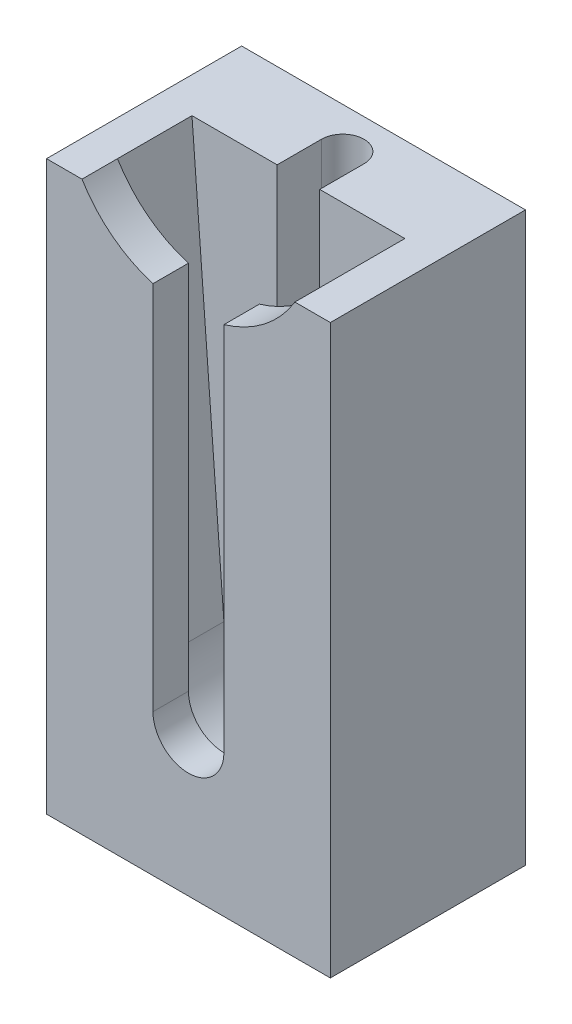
from build123d import *

# Parameters (mm, degrees)
SKICA1_W                      = 8
SKICA1_H                      = 16
P_IDAT_VYSUNUT_M1_DEPTH       = 4.5
ODEBRAT_VYSUNUT_M1_DEPTH      = 19.445866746
ODEBRAT_VYSUNUT_M1_DEPTH_BACK = 2.1
SKICA3_W                      = 8
SKICA3_H                      = 16
P_IDAT_VYSUNUT_M2_DEPTH       = 1
ODEBRAT_VYSUNUT_M2_DEPTH      = 19.714967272
ODEBRAT_VYSUNUT_M2_DEPTH_BACK = 1
ODEBRAT_VYSUNUT_M8_DEPTH      = 19.714967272
ODEBRAT_VYSUNUT_M8_DEPTH_BACK = 10
SKICA10_R                     = 3.5
ODEBRAT_VYSUNUT_M9_DEPTH      = 1
SKICA11_R                     = 0.75
ODEBRAT_VYSUNUT_M10_DEPTH     = 2.5


with BuildPart() as part:
    # Skica1 → P_idat vysunut_m1 (new body)
    with BuildSketch(Plane.XY):
        with Locations((4, 8)):
            Rectangle(SKICA1_W, SKICA1_H)
    extrude(amount=P_IDAT_VYSUNUT_M1_DEPTH)

    # Skica2 → Odebrat vysunut_m1 (cut, two sides: drawn at the far end of the back side and taken through both)
    with BuildSketch(Plane.XY.offset(4.5).offset(-ODEBRAT_VYSUNUT_M1_DEPTH_BACK)):
        with BuildLine():
            Line((4, 16), (1, 16))
            Line((1, 16), (1.9, 4.1))
            ThreePointArc((1.9, 4.1), (4, 2), (6.1, 4.1))
            Line((6.1, 4.1), (7, 16))
            Line((7, 16), (4, 16))
        make_face()
    extrude(amount=ODEBRAT_VYSUNUT_M1_DEPTH + ODEBRAT_VYSUNUT_M1_DEPTH_BACK, mode=Mode.SUBTRACT)

    # Skica3 → P_idat vysunut_m2 (add)
    with BuildSketch(Plane.XY.offset(4.5)):
        with Locations((4, 8)):
            Rectangle(SKICA3_W, SKICA3_H)
    extrude(amount=P_IDAT_VYSUNUT_M2_DEPTH)

    # Skica4 → Odebrat vysunut_m2 (cut, two sides: drawn at the far end of the back side and taken through both)
    with BuildSketch(Plane.XY.offset(5.5).offset(-ODEBRAT_VYSUNUT_M2_DEPTH_BACK)):
        with BuildLine():
            Line((3, 59.526109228), (3, 16))
            Line((3, 16), (3, 4))
            ThreePointArc((3, 4), (4, 3), (5, 4))
            Line((5, 4), (5, 16))
            Line((5, 16), (5, 59.526109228))
            Line((5, 59.526109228), (5, 146.578327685))
            Line((5, 146.578327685), (3, 146.578327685))
            Line((3, 146.578327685), (3, 59.526109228))
        make_face()
    extrude(amount=ODEBRAT_VYSUNUT_M2_DEPTH + ODEBRAT_VYSUNUT_M2_DEPTH_BACK, mode=Mode.SUBTRACT)

    # Skica5 → Odebrat vysunut_m8 (cut, two sides: drawn at the far end of the back side and taken through both)
    with BuildSketch(Plane(origin=(0, 16, 0), x_dir=(1, 0, 0), z_dir=(0, 1, 0)).offset(-ODEBRAT_VYSUNUT_M8_DEPTH_BACK)):
        with BuildLine():
            Line((3.4, -1.15), (3.4, -2.4))
            Line((3.4, -2.4), (4.6, -2.4))
            Line((4.6, -2.4), (4.6, -1.15))
            ThreePointArc((4.6, -1.15), (4, -0.55), (3.4, -1.15))
        make_face()
    extrude(amount=ODEBRAT_VYSUNUT_M8_DEPTH + ODEBRAT_VYSUNUT_M8_DEPTH_BACK, mode=Mode.SUBTRACT)

    # Skica10 → Odebrat vysunut_m9 (cut)
    with BuildSketch(Plane(origin=(0, 0, 4.5), x_dir=(-1, 0, 0), z_dir=(0, 0, -1))):
        with Locations((-4, 17.802775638)):
            Circle(SKICA10_R)
    extrude(amount=-ODEBRAT_VYSUNUT_M9_DEPTH, mode=Mode.SUBTRACT)

    # Skica11 → Odebrat vysunut_m10 (cut)
    with BuildSketch(Plane.XY.offset(2.4)):
        with Locations((4, 4)):
            Circle(SKICA11_R)
    extrude(amount=-ODEBRAT_VYSUNUT_M10_DEPTH, mode=Mode.SUBTRACT)


solid = part.part
